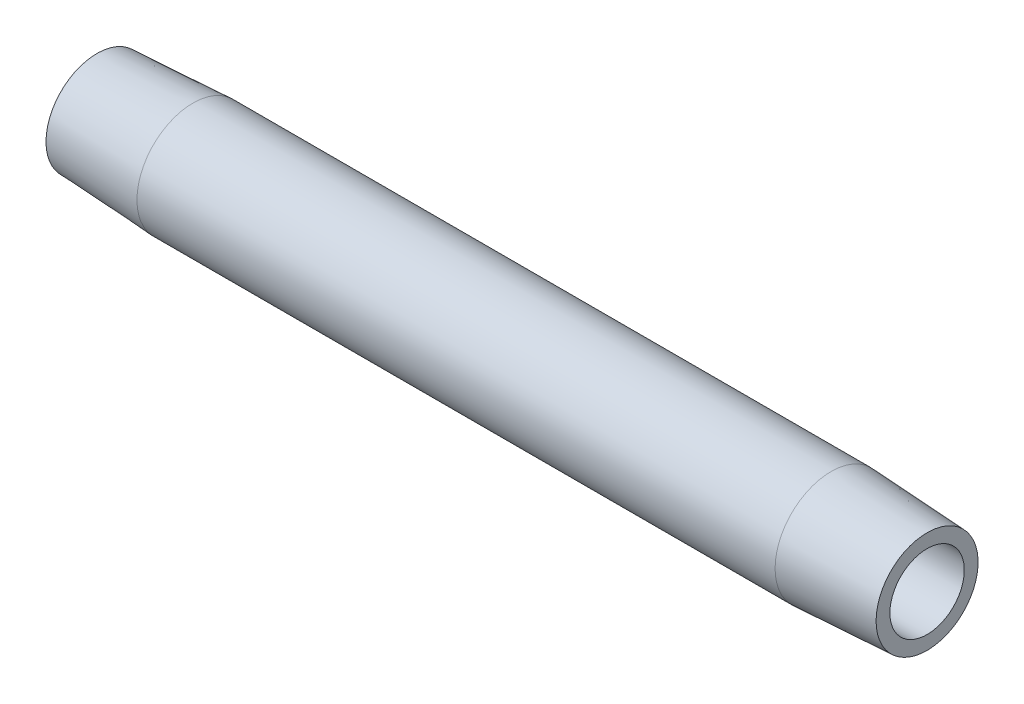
ISO-10303-21;
HEADER;
FILE_DESCRIPTION(('STEP AP214'),'2;1');
FILE_NAME('part.step','',(''),(''),'','','');
FILE_SCHEMA(('AUTOMOTIVE_DESIGN { 1 0 10303 214 1 1 1 1 }'));
ENDSEC;
DATA;
#1=APPLICATION_CONTEXT('core data for automotive mechanical design processes');
#2=APPLICATION_PROTOCOL_DEFINITION('international standard','automotive_design',2000,#1);
#3=PRODUCT_CONTEXT('',#1,'mechanical');
#4=PRODUCT('Part','Part','',(#3));
#5=PRODUCT_RELATED_PRODUCT_CATEGORY('part','',(#4));
#6=PRODUCT_DEFINITION_FORMATION('','',#4);
#7=PRODUCT_DEFINITION_CONTEXT('part definition',#1,'design');
#8=PRODUCT_DEFINITION('design','',#6,#7);
#9=PRODUCT_DEFINITION_SHAPE('','',#8);
#10=(LENGTH_UNIT() NAMED_UNIT(*) SI_UNIT(.MILLI.,.METRE.));
#11=(NAMED_UNIT(*) PLANE_ANGLE_UNIT() SI_UNIT($,.RADIAN.));
#12=(NAMED_UNIT(*) SI_UNIT($,.STERADIAN.) SOLID_ANGLE_UNIT());
#13=UNCERTAINTY_MEASURE_WITH_UNIT(LENGTH_MEASURE(1.E-05),#10,'distance_accuracy_value','');
#14=(GEOMETRIC_REPRESENTATION_CONTEXT(3) GLOBAL_UNCERTAINTY_ASSIGNED_CONTEXT((#13)) GLOBAL_UNIT_ASSIGNED_CONTEXT((#10,
#11,#12)) REPRESENTATION_CONTEXT('',''));
#15=CARTESIAN_POINT('',(0.,0.,0.));
#16=DIRECTION('',(0.,0.,1.));
#17=DIRECTION('',(1.,0.,0.));
#18=AXIS2_PLACEMENT_3D('',#15,#16,#17);
#19=CARTESIAN_POINT('',(0.476141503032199,0.,0.));
#20=DIRECTION('',(-1.,0.,0.));
#21=DIRECTION('',(0.,0.,1.));
#22=AXIS2_PLACEMENT_3D('',#19,#20,#21);
#23=CYLINDRICAL_SURFACE('',#22,5.14349999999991);
#24=CARTESIAN_POINT('',(8.8100393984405,0.,0.));
#25=DIRECTION('',(-1.,0.,0.));
#26=DIRECTION('',(0.,0.,1.));
#27=AXIS2_PLACEMENT_3D('',#24,#25,#26);
#28=CIRCLE('',#27,5.14349999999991);
#29=CARTESIAN_POINT('',(8.8100393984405,0.,5.14349999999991));
#30=VERTEX_POINT('',#29);
#31=EDGE_CURVE('E10',#30,#30,#28,.T.);
#32=ORIENTED_EDGE('',*,*,#31,.F.);
#33=EDGE_LOOP('',(#32));
#34=FACE_BOUND('',#33,.T.);
#35=CARTESIAN_POINT('',(67.3899606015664,0.,0.));
#36=DIRECTION('',(-1.,0.,0.));
#37=DIRECTION('',(0.,0.,1.));
#38=AXIS2_PLACEMENT_3D('',#35,#36,#37);
#39=CIRCLE('',#38,5.14349999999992);
#40=CARTESIAN_POINT('',(67.3899606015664,0.,5.14349999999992));
#41=VERTEX_POINT('',#40);
#42=EDGE_CURVE('E52',#41,#41,#39,.T.);
#43=ORIENTED_EDGE('',*,*,#42,.T.);
#44=EDGE_LOOP('',(#43));
#45=FACE_BOUND('',#44,.T.);
#46=ADVANCED_FACE('F30',(#34,#45),#23,.T.);
#47=CARTESIAN_POINT('',(8.8100393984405,0.,0.));
#48=DIRECTION('',(1.,0.,0.));
#49=DIRECTION('',(0.,0.,-1.));
#50=AXIS2_PLACEMENT_3D('',#47,#48,#49);
#51=CONICAL_SURFACE('',#50,5.14349999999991,0.0523598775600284);
#52=CARTESIAN_POINT('',(0.,0.,0.));
#53=DIRECTION('',(-1.,0.,0.));
#54=DIRECTION('',(0.,0.,1.));
#55=AXIS2_PLACEMENT_3D('',#52,#53,#54);
#56=CIRCLE('',#55,4.68178539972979);
#57=CARTESIAN_POINT('',(0.,0.,4.68178539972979));
#58=VERTEX_POINT('',#57);
#59=EDGE_CURVE('E36',#58,#58,#56,.T.);
#60=ORIENTED_EDGE('',*,*,#59,.F.);
#61=EDGE_LOOP('',(#60));
#62=FACE_BOUND('',#61,.T.);
#63=ORIENTED_EDGE('',*,*,#31,.T.);
#64=EDGE_LOOP('',(#63));
#65=FACE_BOUND('',#64,.T.);
#66=ADVANCED_FACE('F77',(#62,#65),#51,.T.);
#67=CARTESIAN_POINT('',(0.,4.68178539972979,0.));
#68=DIRECTION('',(1.,0.,0.));
#69=DIRECTION('',(0.,0.,-1.));
#70=AXIS2_PLACEMENT_3D('',#67,#68,#69);
#71=PLANE('',#70);
#72=CARTESIAN_POINT('',(0.,0.,0.));
#73=DIRECTION('',(-1.,0.,0.));
#74=DIRECTION('',(0.,0.,1.));
#75=AXIS2_PLACEMENT_3D('',#72,#73,#74);
#76=CIRCLE('',#75,3.4163);
#77=CARTESIAN_POINT('',(0.,0.,3.4163));
#78=VERTEX_POINT('',#77);
#79=EDGE_CURVE('E40',#78,#78,#76,.T.);
#80=ORIENTED_EDGE('',*,*,#79,.F.);
#81=EDGE_LOOP('',(#80));
#82=FACE_BOUND('',#81,.T.);
#83=ORIENTED_EDGE('',*,*,#59,.T.);
#84=EDGE_LOOP('',(#83));
#85=FACE_BOUND('',#84,.T.);
#86=ADVANCED_FACE('F72',(#82,#85),#71,.F.);
#87=CARTESIAN_POINT('',(0.476141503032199,0.,0.));
#88=DIRECTION('',(-1.,0.,0.));
#89=DIRECTION('',(0.,0.,1.));
#90=AXIS2_PLACEMENT_3D('',#87,#88,#89);
#91=CYLINDRICAL_SURFACE('',#90,3.4163);
#92=CARTESIAN_POINT('',(76.2,0.,0.));
#93=DIRECTION('',(-1.,0.,0.));
#94=DIRECTION('',(0.,0.,1.));
#95=AXIS2_PLACEMENT_3D('',#92,#93,#94);
#96=CIRCLE('',#95,3.41630000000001);
#97=CARTESIAN_POINT('',(76.2,0.,3.41630000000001));
#98=VERTEX_POINT('',#97);
#99=EDGE_CURVE('E44',#98,#98,#96,.T.);
#100=ORIENTED_EDGE('',*,*,#99,.F.);
#101=EDGE_LOOP('',(#100));
#102=FACE_BOUND('',#101,.T.);
#103=ORIENTED_EDGE('',*,*,#79,.T.);
#104=EDGE_LOOP('',(#103));
#105=FACE_BOUND('',#104,.T.);
#106=ADVANCED_FACE('F66',(#102,#105),#91,.F.);
#107=CARTESIAN_POINT('',(76.2,3.41630000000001,0.));
#108=DIRECTION('',(-1.,0.,0.));
#109=DIRECTION('',(0.,0.,1.));
#110=AXIS2_PLACEMENT_3D('',#107,#108,#109);
#111=PLANE('',#110);
#112=CARTESIAN_POINT('',(76.2,0.,0.));
#113=DIRECTION('',(-1.,0.,0.));
#114=DIRECTION('',(0.,0.,1.));
#115=AXIS2_PLACEMENT_3D('',#112,#113,#114);
#116=CIRCLE('',#115,4.68178539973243);
#117=CARTESIAN_POINT('',(76.2,0.,4.68178539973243));
#118=VERTEX_POINT('',#117);
#119=EDGE_CURVE('E49',#118,#118,#116,.T.);
#120=ORIENTED_EDGE('',*,*,#119,.F.);
#121=EDGE_LOOP('',(#120));
#122=FACE_BOUND('',#121,.T.);
#123=ORIENTED_EDGE('',*,*,#99,.T.);
#124=EDGE_LOOP('',(#123));
#125=FACE_BOUND('',#124,.T.);
#126=ADVANCED_FACE('F60',(#122,#125),#111,.F.);
#127=CARTESIAN_POINT('',(76.2,0.,0.));
#128=DIRECTION('',(-1.,0.,0.));
#129=DIRECTION('',(0.,0.,1.));
#130=AXIS2_PLACEMENT_3D('',#127,#128,#129);
#131=CONICAL_SURFACE('',#130,4.68178539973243,0.0523598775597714);
#132=ORIENTED_EDGE('',*,*,#42,.F.);
#133=EDGE_LOOP('',(#132));
#134=FACE_BOUND('',#133,.T.);
#135=ORIENTED_EDGE('',*,*,#119,.T.);
#136=EDGE_LOOP('',(#135));
#137=FACE_BOUND('',#136,.T.);
#138=ADVANCED_FACE('F57',(#134,#137),#131,.T.);
#139=CLOSED_SHELL('',(#46,#66,#86,#106,#126,#138));
#140=MANIFOLD_SOLID_BREP('B2',#139);
#141=ADVANCED_BREP_SHAPE_REPRESENTATION('',(#18,#140),#14);
#142=SHAPE_DEFINITION_REPRESENTATION(#9,#141);
ENDSEC;
END-ISO-10303-21;
